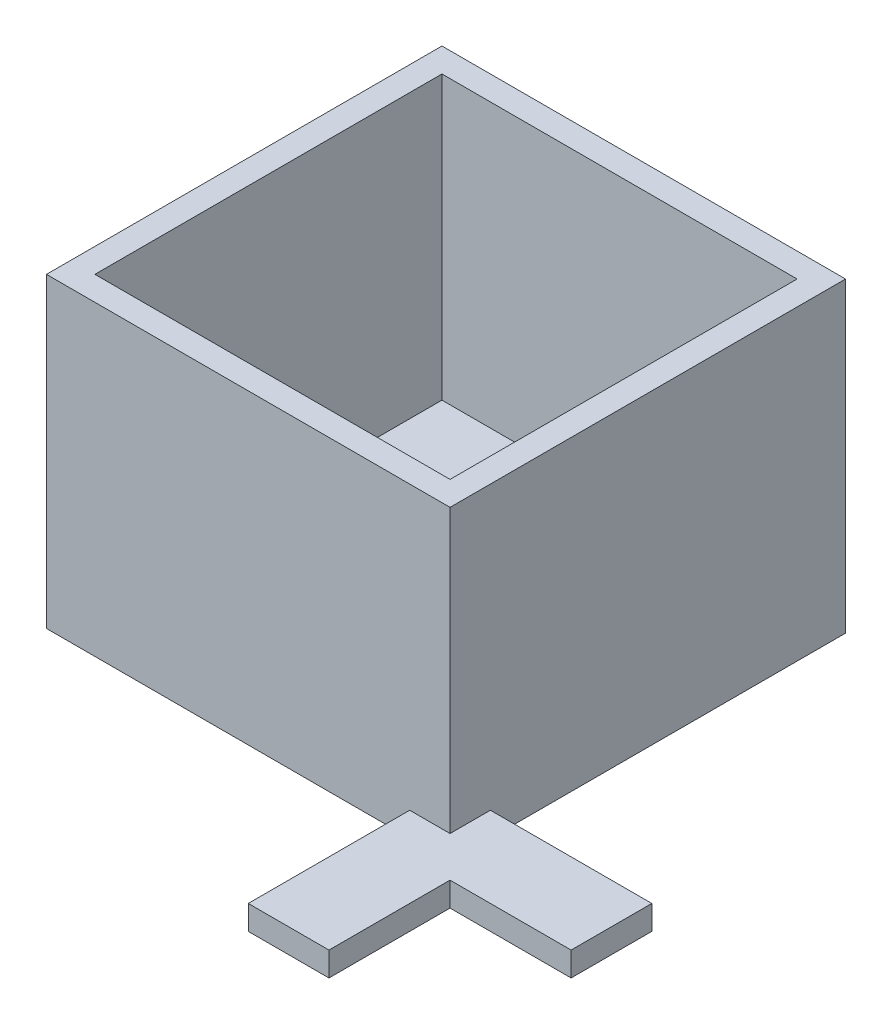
from build123d import *

# Parameters (mm, degrees)
SKETCH2_W           = 50
SKETCH2_H           = 49
BOSS_EXTRUDE1_DEPTH = 38
SKETCH3_W           = 44
SKETCH3_H           = 43
CUT_EXTRUDE1_DEPTH  = 35
BOSS_EXTRUDE2_DEPTH = 3


with BuildPart() as part:
    # Sketch2 → Boss-Extrude1 (new body)
    with BuildSketch(Plane(origin=(0, 0, 0), x_dir=(1, 0, 0), z_dir=(0, 1, 0))):
        with Locations((25, 24.5)):
            Rectangle(SKETCH2_W, SKETCH2_H)
    extrude(amount=BOSS_EXTRUDE1_DEPTH)

    # Sketch3 → Cut-Extrude1 (cut)
    with BuildSketch(Plane(origin=(0, 38, 0), x_dir=(1, 0, 0), z_dir=(0, 1, 0))):
        with Locations((25, 24.5)):
            Rectangle(SKETCH3_W, SKETCH3_H)
    extrude(amount=-CUT_EXTRUDE1_DEPTH, mode=Mode.SUBTRACT)

    # Sketch4 → Boss-Extrude2 (add)
    with BuildSketch(Plane.XZ):
        Polygon((50, 0), (45, 0), (45, 20), (55, 20), (55, 5), (70, 5), (70, -5), (50, -5), align=None)
    extrude(amount=-BOSS_EXTRUDE2_DEPTH)


solid = part.part
